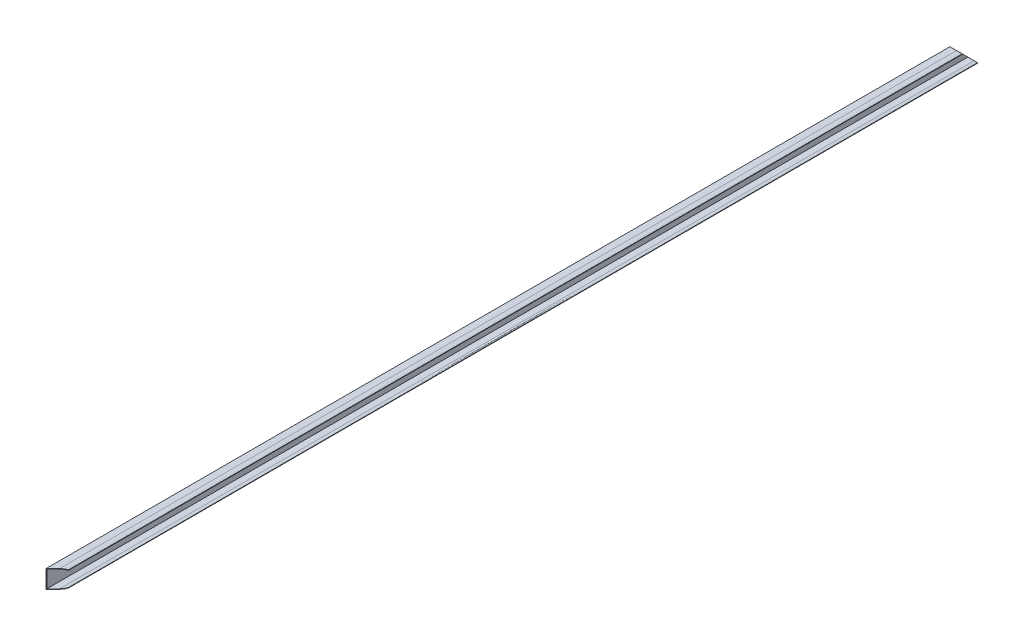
from build123d import *

# Parameters (mm, degrees)
EXTRUSION1_DEPTH = 4100
EXTRUSION3_REACH = 4103.085
EXTRUSION4_REACH = 4103.085


with BuildPart() as part:
    # Esquisse1 → Extrusion1 (new body)
    with BuildSketch(Plane.XY):
        with BuildLine():
            Line((0, 0), (0, 80))
            Line((0, 80), (30, 80))
            add(Edge.make_bspline(
                [(30, 80), (40.603281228, 79.951543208), (50, 75)],
                knots=[0, 0, 0, 1, 1, 1], degree=2))
            Line((50, 75), (50, 73))
            add(Edge.make_bspline(
                [(30, 78), (40.603281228, 77.951543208), (50, 73)],
                knots=[0, 0, 0, 1, 1, 1], degree=2))
            Line((30, 78), (2, 78))
            Line((2, 78), (2, 2))
            Line((2, 2), (30, 2))
            add(Edge.make_bspline(
                [(30, 2), (40.603281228, 2.048456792), (50, 7)],
                knots=[0, 0, 0, 1, 1, 1], degree=2))
            Line((50, 7), (50, 5))
            add(Edge.make_bspline(
                [(30, 0), (40.603281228, 0.048456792), (50, 5)],
                knots=[0, 0, 0, 1, 1, 1], degree=2))
            Line((30, 0), (0, 0))
        make_face()
    extrude(amount=EXTRUSION1_DEPTH)

    # Esquisse2 → Extrusion3 (cut, up to next)
    with BuildSketch(Plane(origin=(0, 80, 0), x_dir=(-1, 0, 0), z_dir=(0, 1, 0)), mode=Mode.PRIVATE) as extrusion3_sk1:
        Polygon((0, 4100), (-50, 4050), (-50, 4100), align=None)
    extrusion3_tool1 = extrude(extrusion3_sk1.sketch, amount=-EXTRUSION3_REACH, mode=Mode.PRIVATE) & part.part
    add(extrusion3_tool1.solids().sort_by_distance((33.333333, 80, 4083.333333))[0], mode=Mode.SUBTRACT)

    # Esquisse3 → Extrusion4 (cut, up to next)
    with BuildSketch(Plane.ZY, mode=Mode.PRIVATE) as extrusion4_sk1:
        Polygon((0, 80), (80, 80), (0, 0), align=None)
    extrusion4_tool1 = extrude(extrusion4_sk1.sketch, amount=-EXTRUSION4_REACH, mode=Mode.PRIVATE) & part.part
    add(extrusion4_tool1.solids().sort_by_distance((0, 53.333333, 26.666667))[0], mode=Mode.SUBTRACT)


solid = part.part
